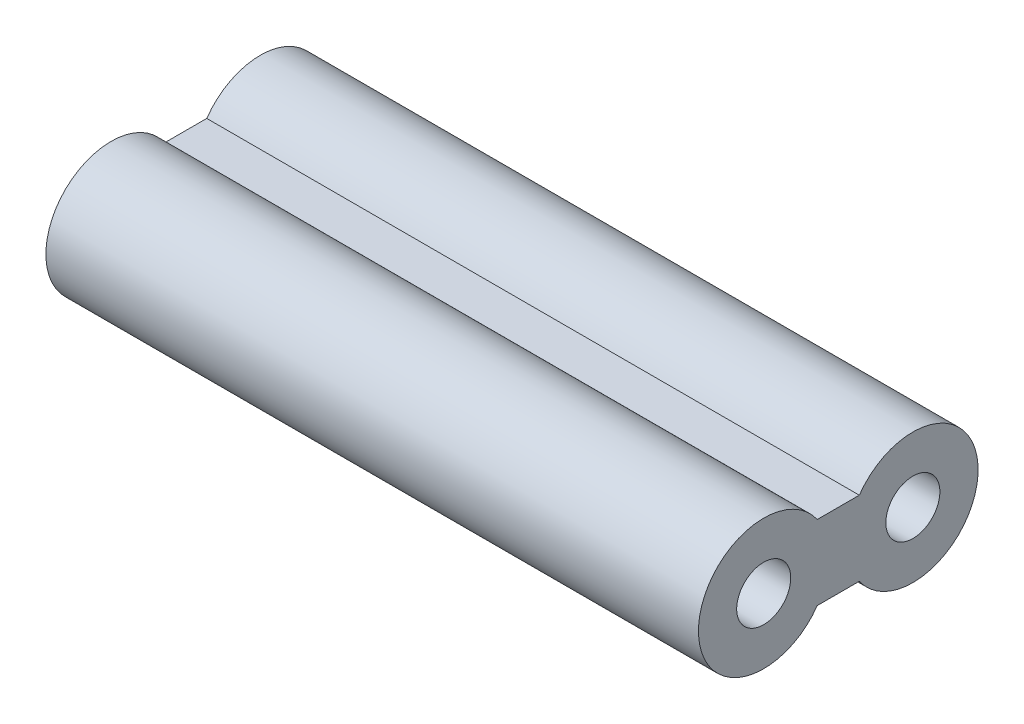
from build123d import *

# Parameters (mm, degrees)
SKETCH1_R           = 3.5
SKETCH1_R_2         = 1.45
BOSS_EXTRUDE1_DEPTH = 17.5
SKETCH2_R           = 1.45
BOSS_EXTRUDE2_DEPTH = 35


with BuildPart() as part:
    # Sketch1 → Boss-Extrude1 (new, symmetric)
    with BuildSketch(Plane(origin=(0, 0, 0), x_dir=(0, 0, -1), z_dir=(1, 0, 0))):
        Circle(SKETCH1_R)
        Circle(SKETCH1_R_2, mode=Mode.SUBTRACT)
    extrude(amount=BOSS_EXTRUDE1_DEPTH, both=True)

    # Sketch2 → Boss-Extrude2 (add)
    with BuildSketch(Plane(origin=(17.5, 0, 0), x_dir=(0, 0, -1), z_dir=(1, 0, 0))):
        with BuildLine():
            Line((2.872281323, -2), (5.127718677, -2))
            ThreePointArc((5.127718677, -2), (11.5, 0), (5.127718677, 2))
            Line((5.127718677, 2), (2.872281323, 2))
            ThreePointArc((2.872281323, 2), (3.5, 0), (2.872281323, -2))
        make_face()
        with Locations((8, 0)):
            Circle(SKETCH2_R, mode=Mode.SUBTRACT)
    extrude(amount=-BOSS_EXTRUDE2_DEPTH)


solid = part.part
